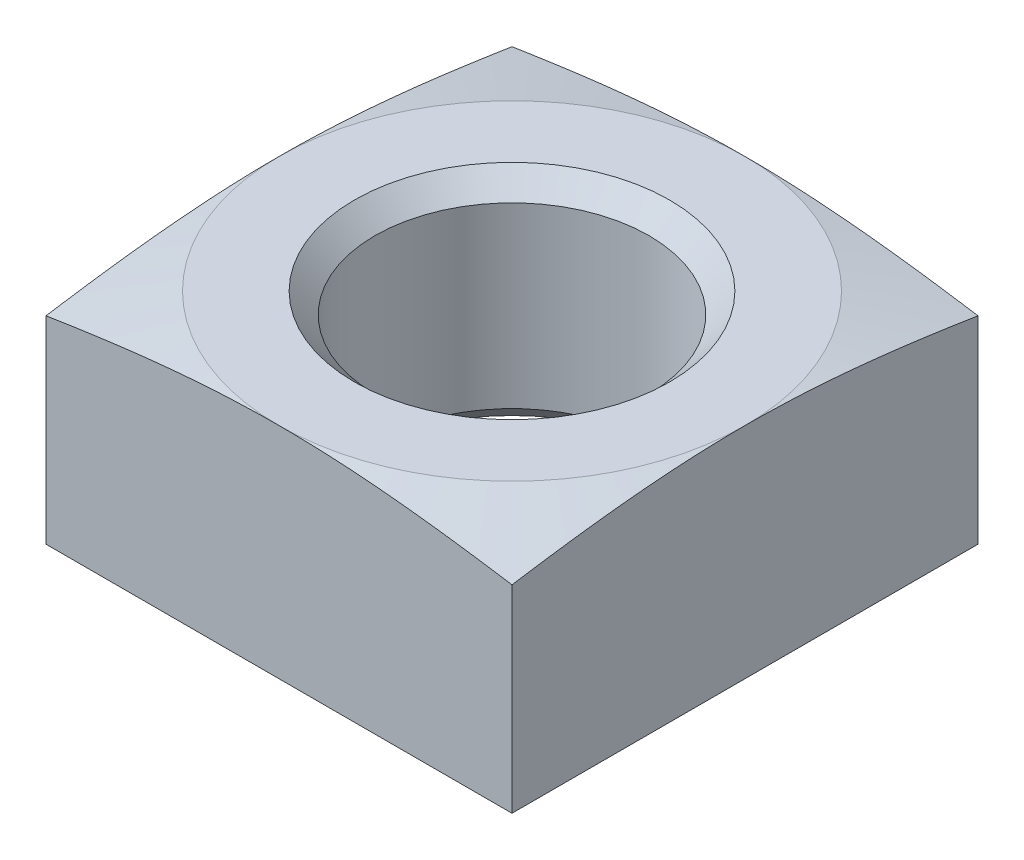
from build123d import *

# Parameters (mm, degrees)
SKETCH8_W           = 17
SKETCH8_H           = 8
BOSS_EXTRUDE2_DEPTH = 8.5
SKETCH11_R          = 5
CUT_EXTRUDE1_DEPTH  = 8
CHAMFER1_SIZE       = 0.75


with BuildPart() as part:
    # Sketch8 → Boss-Extrude2 (new, symmetric)
    with BuildSketch(Plane(origin=(0, 0, 0), x_dir=(0, 0, -1), z_dir=(1, 0, 0))):
        Rectangle(SKETCH8_W, SKETCH8_H)
    extrude(amount=BOSS_EXTRUDE2_DEPTH, both=True)

    # Sketch10 → Cut-Revolve1 (revolve, cut)
    with BuildSketch(Plane(origin=(0, 0, 0), x_dir=(0, 0, -1), z_dir=(1, 0, 0))):
        Polygon((-8.5, 4), (-12.1, 4), (-12.1, 3.2), align=None)
    revolve(axis=Axis((0, 59.838437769, 0), (0, -1, 0)), mode=Mode.SUBTRACT)

    # Sketch11 → Cut-Extrude1 (cut)
    with BuildSketch(Plane(origin=(0, 4, 0), x_dir=(1, 0, 0), z_dir=(0, 1, 0))):
        with Locations(Location((0, 0, 0), (0, 0, 270))):
            Circle(SKETCH11_R)
    extrude(amount=-CUT_EXTRUDE1_DEPTH, mode=Mode.SUBTRACT)

    # Chamfer1
    chamfer1_edges = [part.edges().sort_by_distance(p)[0] for p in [
        (0, 4, -5),
        (0, -4, -5),
    ]]
    chamfer(chamfer1_edges, length=CHAMFER1_SIZE)


solid = part.part
